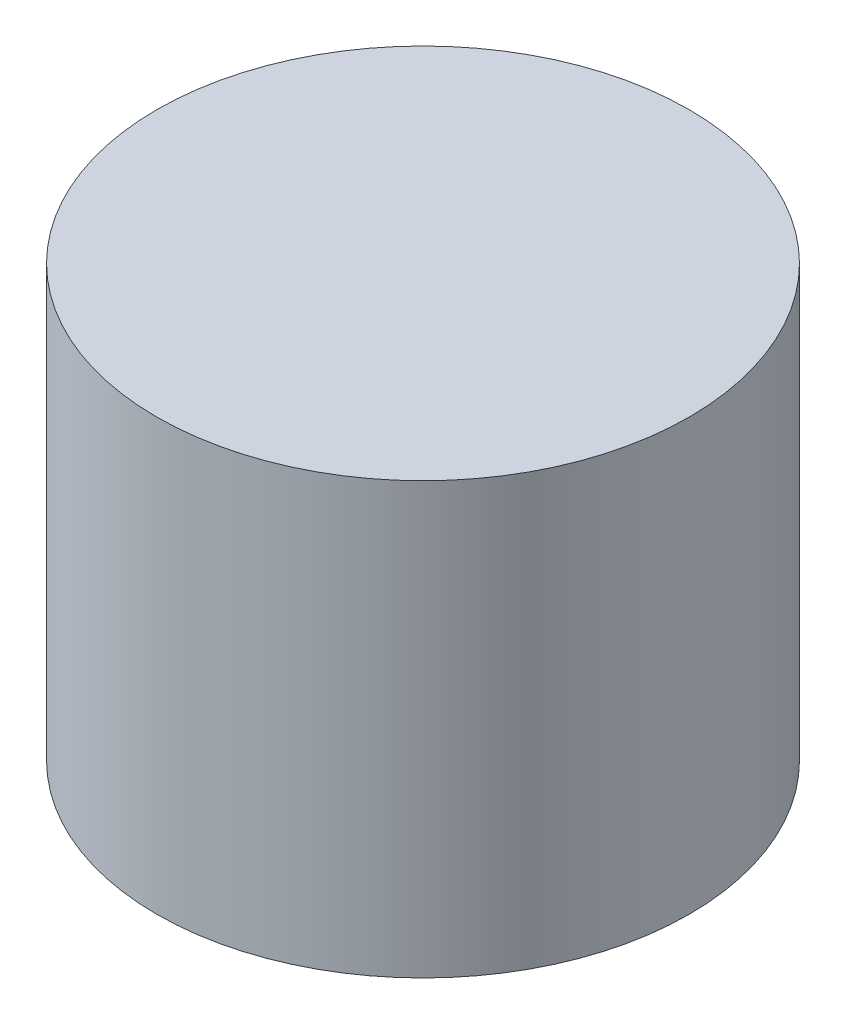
from build123d import *


with BuildPart() as part:
    # Sketch1 → Revolve1 (revolve)
    with BuildSketch(Plane.XY, mode=Mode.PRIVATE) as revolve1_sk:
        Polygon((1.05, 2.75), (1.05, 0), (3.4, 0), (3.4, 5.5), (0, 5.5), (0, 4.15), (2.625, 4.15), (2.625, 2.75), align=None)
    revolve(revolve1_sk.sketch.rotate(Axis((0, 0, 0), (0, 1, 0)), 90), axis=Axis((0, 0, 0), (0, 1, 0)))


solid = part.part
